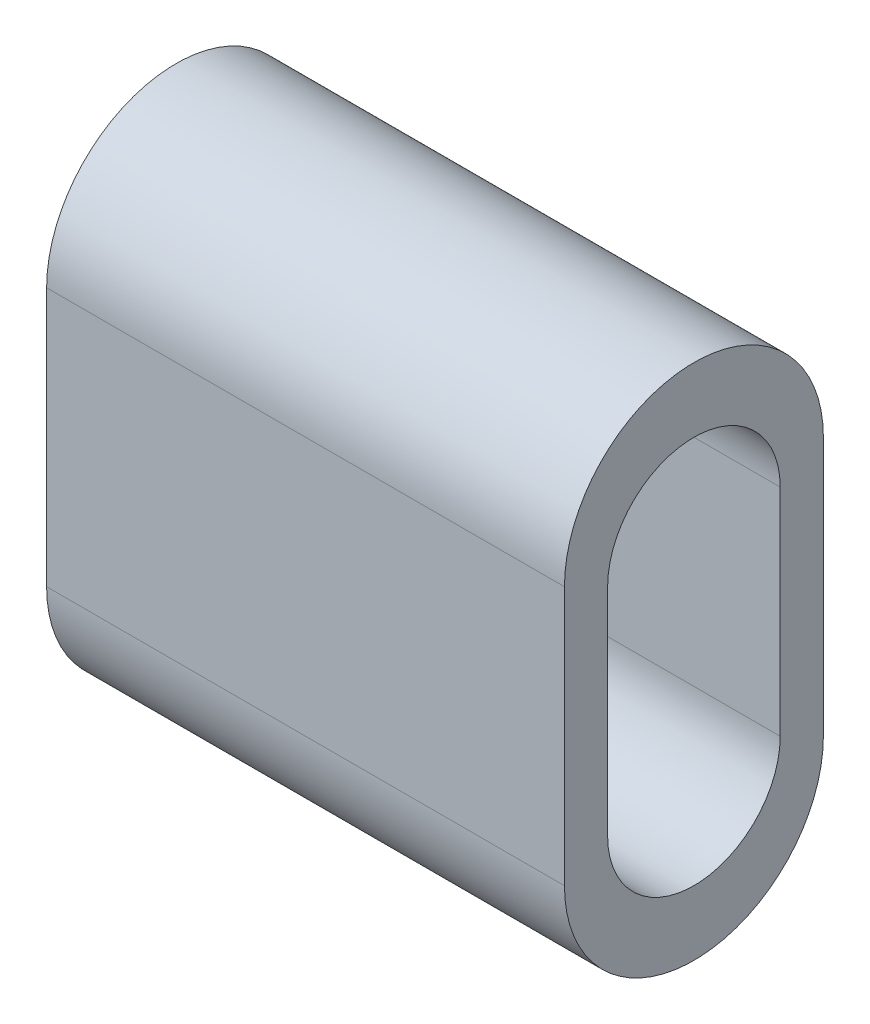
ISO-10303-21;
HEADER;
FILE_DESCRIPTION(('STEP AP214'),'2;1');
FILE_NAME('part.step','',(''),(''),'','','');
FILE_SCHEMA(('AUTOMOTIVE_DESIGN { 1 0 10303 214 1 1 1 1 }'));
ENDSEC;
DATA;
#1=APPLICATION_CONTEXT('core data for automotive mechanical design processes');
#2=APPLICATION_PROTOCOL_DEFINITION('international standard','automotive_design',2000,#1);
#3=PRODUCT_CONTEXT('',#1,'mechanical');
#4=PRODUCT('Part','Part','',(#3));
#5=PRODUCT_RELATED_PRODUCT_CATEGORY('part','',(#4));
#6=PRODUCT_DEFINITION_FORMATION('','',#4);
#7=PRODUCT_DEFINITION_CONTEXT('part definition',#1,'design');
#8=PRODUCT_DEFINITION('design','',#6,#7);
#9=PRODUCT_DEFINITION_SHAPE('','',#8);
#10=(LENGTH_UNIT() NAMED_UNIT(*) SI_UNIT(.MILLI.,.METRE.));
#11=(NAMED_UNIT(*) PLANE_ANGLE_UNIT() SI_UNIT($,.RADIAN.));
#12=(NAMED_UNIT(*) SI_UNIT($,.STERADIAN.) SOLID_ANGLE_UNIT());
#13=UNCERTAINTY_MEASURE_WITH_UNIT(LENGTH_MEASURE(1.E-05),#10,'distance_accuracy_value','');
#14=(GEOMETRIC_REPRESENTATION_CONTEXT(3) GLOBAL_UNCERTAINTY_ASSIGNED_CONTEXT((#13)) GLOBAL_UNIT_ASSIGNED_CONTEXT((#10,
#11,#12)) REPRESENTATION_CONTEXT('',''));
#15=CARTESIAN_POINT('',(0.,0.,0.));
#16=DIRECTION('',(0.,0.,1.));
#17=DIRECTION('',(1.,0.,0.));
#18=AXIS2_PLACEMENT_3D('',#15,#16,#17);
#19=CARTESIAN_POINT('',(0.,-3.,0.));
#20=DIRECTION('',(1.,0.,0.));
#21=DIRECTION('',(0.,0.,-1.));
#22=AXIS2_PLACEMENT_3D('',#19,#20,#21);
#23=CYLINDRICAL_SURFACE('',#22,3.);
#24=CARTESIAN_POINT('',(12.,-3.,0.));
#25=DIRECTION('',(1.,0.,0.));
#26=DIRECTION('',(0.,0.,-1.));
#27=AXIS2_PLACEMENT_3D('',#24,#25,#26);
#28=CIRCLE('',#27,3.);
#29=CARTESIAN_POINT('',(12.,-3.,3.));
#30=VERTEX_POINT('',#29);
#31=CARTESIAN_POINT('',(12.,-3.,-3.));
#32=VERTEX_POINT('',#31);
#33=EDGE_CURVE('E133',#30,#32,#28,.T.);
#34=ORIENTED_EDGE('',*,*,#33,.F.);
#35=DIRECTION('',(1.,0.,0.));
#36=VECTOR('',#35,1.);
#37=CARTESIAN_POINT('',(0.,-3.,3.));
#38=LINE('',#37,#36);
#39=CARTESIAN_POINT('',(0.,-3.,3.));
#40=VERTEX_POINT('',#39);
#41=EDGE_CURVE('E11',#40,#30,#38,.T.);
#42=ORIENTED_EDGE('',*,*,#41,.F.);
#43=CARTESIAN_POINT('',(0.,-3.,0.));
#44=DIRECTION('',(1.,0.,0.));
#45=DIRECTION('',(0.,0.,-1.));
#46=AXIS2_PLACEMENT_3D('',#43,#44,#45);
#47=CIRCLE('',#46,3.);
#48=CARTESIAN_POINT('',(0.,-3.,-3.));
#49=VERTEX_POINT('',#48);
#50=EDGE_CURVE('E137',#40,#49,#47,.T.);
#51=ORIENTED_EDGE('',*,*,#50,.T.);
#52=DIRECTION('',(1.,0.,0.));
#53=VECTOR('',#52,1.);
#54=CARTESIAN_POINT('',(0.,-3.,-3.));
#55=LINE('',#54,#53);
#56=EDGE_CURVE('E38',#49,#32,#55,.T.);
#57=ORIENTED_EDGE('',*,*,#56,.T.);
#58=EDGE_LOOP('',(#34,#42,#51,#57));
#59=FACE_BOUND('',#58,.T.);
#60=ADVANCED_FACE('F35',(#59),#23,.T.);
#61=CARTESIAN_POINT('',(0.,3.,3.));
#62=DIRECTION('',(0.,0.,1.));
#63=DIRECTION('',(1.,0.,0.));
#64=AXIS2_PLACEMENT_3D('',#61,#62,#63);
#65=PLANE('',#64);
#66=DIRECTION('',(0.,-1.,0.));
#67=VECTOR('',#66,1.);
#68=CARTESIAN_POINT('',(12.,3.,3.));
#69=LINE('',#68,#67);
#70=CARTESIAN_POINT('',(12.,3.,3.));
#71=VERTEX_POINT('',#70);
#72=EDGE_CURVE('E141',#71,#30,#69,.T.);
#73=ORIENTED_EDGE('',*,*,#72,.F.);
#74=DIRECTION('',(1.,0.,0.));
#75=VECTOR('',#74,1.);
#76=CARTESIAN_POINT('',(0.,3.,3.));
#77=LINE('',#76,#75);
#78=CARTESIAN_POINT('',(0.,3.,3.));
#79=VERTEX_POINT('',#78);
#80=EDGE_CURVE('E43',#79,#71,#77,.T.);
#81=ORIENTED_EDGE('',*,*,#80,.F.);
#82=DIRECTION('',(0.,-1.,0.));
#83=VECTOR('',#82,1.);
#84=CARTESIAN_POINT('',(0.,3.,3.));
#85=LINE('',#84,#83);
#86=EDGE_CURVE('E147',#79,#40,#85,.T.);
#87=ORIENTED_EDGE('',*,*,#86,.T.);
#88=ORIENTED_EDGE('',*,*,#41,.T.);
#89=EDGE_LOOP('',(#73,#81,#87,#88));
#90=FACE_BOUND('',#89,.T.);
#91=ADVANCED_FACE('F173',(#90),#65,.T.);
#92=CARTESIAN_POINT('',(0.,3.,0.));
#93=DIRECTION('',(1.,0.,0.));
#94=DIRECTION('',(0.,0.,-1.));
#95=AXIS2_PLACEMENT_3D('',#92,#93,#94);
#96=CYLINDRICAL_SURFACE('',#95,3.);
#97=CARTESIAN_POINT('',(12.,3.,0.));
#98=DIRECTION('',(1.,0.,0.));
#99=DIRECTION('',(0.,0.,-1.));
#100=AXIS2_PLACEMENT_3D('',#97,#98,#99);
#101=CIRCLE('',#100,3.);
#102=CARTESIAN_POINT('',(12.,3.,-3.));
#103=VERTEX_POINT('',#102);
#104=EDGE_CURVE('E155',#103,#71,#101,.T.);
#105=ORIENTED_EDGE('',*,*,#104,.F.);
#106=DIRECTION('',(1.,0.,0.));
#107=VECTOR('',#106,1.);
#108=CARTESIAN_POINT('',(0.,3.,-3.));
#109=LINE('',#108,#107);
#110=CARTESIAN_POINT('',(0.,3.,-3.));
#111=VERTEX_POINT('',#110);
#112=EDGE_CURVE('E160',#111,#103,#109,.T.);
#113=ORIENTED_EDGE('',*,*,#112,.F.);
#114=CARTESIAN_POINT('',(0.,3.,0.));
#115=DIRECTION('',(1.,0.,0.));
#116=DIRECTION('',(0.,0.,-1.));
#117=AXIS2_PLACEMENT_3D('',#114,#115,#116);
#118=CIRCLE('',#117,3.);
#119=EDGE_CURVE('E144',#111,#79,#118,.T.);
#120=ORIENTED_EDGE('',*,*,#119,.T.);
#121=ORIENTED_EDGE('',*,*,#80,.T.);
#122=EDGE_LOOP('',(#105,#113,#120,#121));
#123=FACE_BOUND('',#122,.T.);
#124=ADVANCED_FACE('F177',(#123),#96,.T.);
#125=CARTESIAN_POINT('',(0.,-3.,-3.));
#126=DIRECTION('',(0.,0.,-1.));
#127=DIRECTION('',(-1.,0.,0.));
#128=AXIS2_PLACEMENT_3D('',#125,#126,#127);
#129=PLANE('',#128);
#130=DIRECTION('',(0.,1.,0.));
#131=VECTOR('',#130,1.);
#132=CARTESIAN_POINT('',(12.,-3.,-3.));
#133=LINE('',#132,#131);
#134=EDGE_CURVE('E152',#32,#103,#133,.T.);
#135=ORIENTED_EDGE('',*,*,#134,.F.);
#136=ORIENTED_EDGE('',*,*,#56,.F.);
#137=DIRECTION('',(0.,1.,0.));
#138=VECTOR('',#137,1.);
#139=CARTESIAN_POINT('',(0.,-3.,-3.));
#140=LINE('',#139,#138);
#141=EDGE_CURVE('E140',#49,#111,#140,.T.);
#142=ORIENTED_EDGE('',*,*,#141,.T.);
#143=ORIENTED_EDGE('',*,*,#112,.T.);
#144=EDGE_LOOP('',(#135,#136,#142,#143));
#145=FACE_BOUND('',#144,.T.);
#146=ADVANCED_FACE('F168',(#145),#129,.T.);
#147=CARTESIAN_POINT('',(0.,-3.,0.));
#148=DIRECTION('',(1.,0.,0.));
#149=DIRECTION('',(0.,0.,-1.));
#150=AXIS2_PLACEMENT_3D('',#147,#148,#149);
#151=PLANE('',#150);
#152=DIRECTION('',(0.,1.,0.));
#153=VECTOR('',#152,1.);
#154=CARTESIAN_POINT('',(0.,2.5,-2.));
#155=LINE('',#154,#153);
#156=CARTESIAN_POINT('',(0.,-2.5,-2.));
#157=VERTEX_POINT('',#156);
#158=CARTESIAN_POINT('',(0.,2.5,-2.));
#159=VERTEX_POINT('',#158);
#160=EDGE_CURVE('E108',#157,#159,#155,.T.);
#161=ORIENTED_EDGE('',*,*,#160,.T.);
#162=CARTESIAN_POINT('',(0.,2.5,0.));
#163=DIRECTION('',(1.,0.,0.));
#164=DIRECTION('',(0.,0.,1.));
#165=AXIS2_PLACEMENT_3D('',#162,#163,#164);
#166=CIRCLE('',#165,2.);
#167=CARTESIAN_POINT('',(0.,2.5,2.));
#168=VERTEX_POINT('',#167);
#169=EDGE_CURVE('E102',#159,#168,#166,.T.);
#170=ORIENTED_EDGE('',*,*,#169,.T.);
#171=DIRECTION('',(0.,-1.,0.));
#172=VECTOR('',#171,1.);
#173=CARTESIAN_POINT('',(0.,-2.5,2.));
#174=LINE('',#173,#172);
#175=CARTESIAN_POINT('',(0.,-2.5,2.));
#176=VERTEX_POINT('',#175);
#177=EDGE_CURVE('E111',#168,#176,#174,.T.);
#178=ORIENTED_EDGE('',*,*,#177,.T.);
#179=CARTESIAN_POINT('',(0.,-2.5,0.));
#180=DIRECTION('',(1.,0.,0.));
#181=DIRECTION('',(0.,0.,1.));
#182=AXIS2_PLACEMENT_3D('',#179,#180,#181);
#183=CIRCLE('',#182,2.);
#184=EDGE_CURVE('E51',#176,#157,#183,.T.);
#185=ORIENTED_EDGE('',*,*,#184,.T.);
#186=EDGE_LOOP('',(#161,#170,#178,#185));
#187=FACE_BOUND('',#186,.T.);
#188=ORIENTED_EDGE('',*,*,#50,.F.);
#189=ORIENTED_EDGE('',*,*,#86,.F.);
#190=ORIENTED_EDGE('',*,*,#119,.F.);
#191=ORIENTED_EDGE('',*,*,#141,.F.);
#192=EDGE_LOOP('',(#188,#189,#190,#191));
#193=FACE_BOUND('',#192,.T.);
#194=ADVANCED_FACE('F115',(#187,#193),#151,.F.);
#195=CARTESIAN_POINT('',(12.,-3.,0.));
#196=DIRECTION('',(1.,0.,0.));
#197=DIRECTION('',(0.,0.,-1.));
#198=AXIS2_PLACEMENT_3D('',#195,#196,#197);
#199=PLANE('',#198);
#200=CARTESIAN_POINT('',(12.,2.5,0.));
#201=DIRECTION('',(1.,0.,0.));
#202=DIRECTION('',(0.,0.,1.));
#203=AXIS2_PLACEMENT_3D('',#200,#201,#202);
#204=CIRCLE('',#203,2.);
#205=CARTESIAN_POINT('',(12.,2.5,-2.));
#206=VERTEX_POINT('',#205);
#207=CARTESIAN_POINT('',(12.,2.5,2.));
#208=VERTEX_POINT('',#207);
#209=EDGE_CURVE('E59',#206,#208,#204,.T.);
#210=ORIENTED_EDGE('',*,*,#209,.F.);
#211=DIRECTION('',(0.,1.,0.));
#212=VECTOR('',#211,1.);
#213=CARTESIAN_POINT('',(12.,2.5,-2.));
#214=LINE('',#213,#212);
#215=CARTESIAN_POINT('',(12.,-2.5,-2.));
#216=VERTEX_POINT('',#215);
#217=EDGE_CURVE('E118',#216,#206,#214,.T.);
#218=ORIENTED_EDGE('',*,*,#217,.F.);
#219=CARTESIAN_POINT('',(12.,-2.5,0.));
#220=DIRECTION('',(1.,0.,0.));
#221=DIRECTION('',(0.,0.,1.));
#222=AXIS2_PLACEMENT_3D('',#219,#220,#221);
#223=CIRCLE('',#222,2.);
#224=CARTESIAN_POINT('',(12.,-2.5,2.));
#225=VERTEX_POINT('',#224);
#226=EDGE_CURVE('E121',#225,#216,#223,.T.);
#227=ORIENTED_EDGE('',*,*,#226,.F.);
#228=DIRECTION('',(0.,-1.,0.));
#229=VECTOR('',#228,1.);
#230=CARTESIAN_POINT('',(12.,-2.5,2.));
#231=LINE('',#230,#229);
#232=EDGE_CURVE('E127',#208,#225,#231,.T.);
#233=ORIENTED_EDGE('',*,*,#232,.F.);
#234=EDGE_LOOP('',(#210,#218,#227,#233));
#235=FACE_BOUND('',#234,.T.);
#236=ORIENTED_EDGE('',*,*,#33,.T.);
#237=ORIENTED_EDGE('',*,*,#134,.T.);
#238=ORIENTED_EDGE('',*,*,#104,.T.);
#239=ORIENTED_EDGE('',*,*,#72,.T.);
#240=EDGE_LOOP('',(#236,#237,#238,#239));
#241=FACE_BOUND('',#240,.T.);
#242=ADVANCED_FACE('F170',(#235,#241),#199,.T.);
#243=CARTESIAN_POINT('',(0.,2.5,0.));
#244=DIRECTION('',(1.,0.,0.));
#245=DIRECTION('',(0.,0.,-1.));
#246=AXIS2_PLACEMENT_3D('',#243,#244,#245);
#247=CYLINDRICAL_SURFACE('',#246,2.);
#248=ORIENTED_EDGE('',*,*,#209,.T.);
#249=DIRECTION('',(1.,0.,0.));
#250=VECTOR('',#249,1.);
#251=CARTESIAN_POINT('',(0.,2.5,2.));
#252=LINE('',#251,#250);
#253=EDGE_CURVE('E98',#168,#208,#252,.T.);
#254=ORIENTED_EDGE('',*,*,#253,.F.);
#255=ORIENTED_EDGE('',*,*,#169,.F.);
#256=DIRECTION('',(1.,0.,0.));
#257=VECTOR('',#256,1.);
#258=CARTESIAN_POINT('',(0.,2.5,-2.));
#259=LINE('',#258,#257);
#260=EDGE_CURVE('E131',#159,#206,#259,.T.);
#261=ORIENTED_EDGE('',*,*,#260,.T.);
#262=EDGE_LOOP('',(#248,#254,#255,#261));
#263=FACE_BOUND('',#262,.T.);
#264=ADVANCED_FACE('F100',(#263),#247,.F.);
#265=CARTESIAN_POINT('',(0.,2.5,-2.));
#266=DIRECTION('',(0.,0.,-1.));
#267=DIRECTION('',(-1.,0.,0.));
#268=AXIS2_PLACEMENT_3D('',#265,#266,#267);
#269=PLANE('',#268);
#270=ORIENTED_EDGE('',*,*,#217,.T.);
#271=ORIENTED_EDGE('',*,*,#260,.F.);
#272=ORIENTED_EDGE('',*,*,#160,.F.);
#273=DIRECTION('',(1.,0.,0.));
#274=VECTOR('',#273,1.);
#275=CARTESIAN_POINT('',(0.,-2.5,-2.));
#276=LINE('',#275,#274);
#277=EDGE_CURVE('E134',#157,#216,#276,.T.);
#278=ORIENTED_EDGE('',*,*,#277,.T.);
#279=EDGE_LOOP('',(#270,#271,#272,#278));
#280=FACE_BOUND('',#279,.T.);
#281=ADVANCED_FACE('F228',(#280),#269,.F.);
#282=CARTESIAN_POINT('',(0.,-2.5,0.));
#283=DIRECTION('',(1.,0.,0.));
#284=DIRECTION('',(0.,0.,-1.));
#285=AXIS2_PLACEMENT_3D('',#282,#283,#284);
#286=CYLINDRICAL_SURFACE('',#285,2.);
#287=ORIENTED_EDGE('',*,*,#226,.T.);
#288=ORIENTED_EDGE('',*,*,#277,.F.);
#289=ORIENTED_EDGE('',*,*,#184,.F.);
#290=DIRECTION('',(1.,0.,0.));
#291=VECTOR('',#290,1.);
#292=CARTESIAN_POINT('',(0.,-2.5,2.));
#293=LINE('',#292,#291);
#294=EDGE_CURVE('E107',#176,#225,#293,.T.);
#295=ORIENTED_EDGE('',*,*,#294,.T.);
#296=EDGE_LOOP('',(#287,#288,#289,#295));
#297=FACE_BOUND('',#296,.T.);
#298=ADVANCED_FACE('F237',(#297),#286,.F.);
#299=CARTESIAN_POINT('',(0.,-2.5,2.));
#300=DIRECTION('',(0.,0.,1.));
#301=DIRECTION('',(1.,0.,0.));
#302=AXIS2_PLACEMENT_3D('',#299,#300,#301);
#303=PLANE('',#302);
#304=ORIENTED_EDGE('',*,*,#232,.T.);
#305=ORIENTED_EDGE('',*,*,#294,.F.);
#306=ORIENTED_EDGE('',*,*,#177,.F.);
#307=ORIENTED_EDGE('',*,*,#253,.T.);
#308=EDGE_LOOP('',(#304,#305,#306,#307));
#309=FACE_BOUND('',#308,.T.);
#310=ADVANCED_FACE('F112',(#309),#303,.F.);
#311=CLOSED_SHELL('',(#60,#91,#124,#146,#194,#242,#264,#281,#298,#310));
#312=MANIFOLD_SOLID_BREP('B2',#311);
#313=ADVANCED_BREP_SHAPE_REPRESENTATION('',(#18,#312),#14);
#314=SHAPE_DEFINITION_REPRESENTATION(#9,#313);
ENDSEC;
END-ISO-10303-21;
